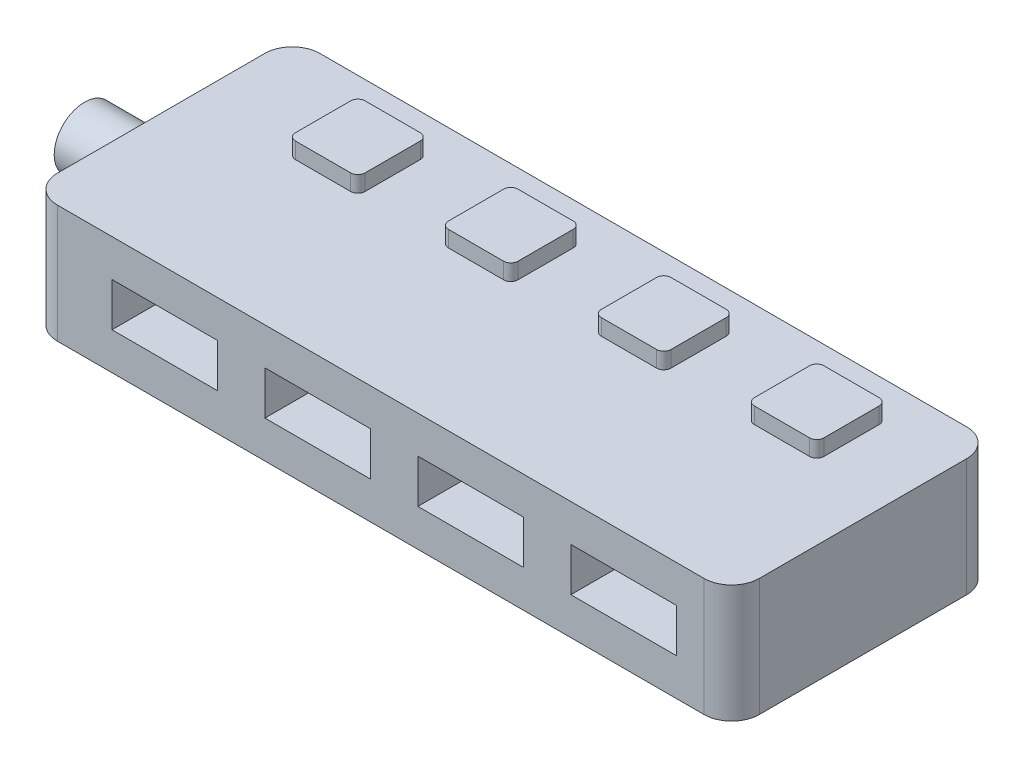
from build123d import *

# Parameters (mm, degrees)
BOSS_EXTRUDE1_DEPTH = 14.097
BOSS_EXTRUDE2_DEPTH = 1.9304
SKETCH4_W           = 12.6111
SKETCH4_H           = 5.207
CUT_EXTRUDE1_DEPTH  = 9.144
SKETCH5_R           = 3.6322
BOSS_EXTRUDE3_DEPTH = 9.144


with BuildPart() as part:
    # Sketch1 → Boss-Extrude1 (new body)
    with BuildSketch(Plane(origin=(0, 0, 0), x_dir=(1, 0, 0), z_dir=(0, 1, 0))):
        with BuildLine():
            Line((0, 0), (0, 24.7904))
            ThreePointArc((0, 24.7904), (0.967133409, 27.125266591), (3.302, 28.0924))
            Line((3.302, 28.0924), (80.6196, 28.0924))
            ThreePointArc((80.6196, 28.0924), (82.954466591, 27.125266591), (83.9216, 24.7904))
            Line((83.9216, 24.7904), (83.9216, 0))
            ThreePointArc((83.9216, 0), (82.954466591, -2.334866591), (80.6196, -3.302))
            Line((80.6196, -3.302), (3.302, -3.302))
            ThreePointArc((3.302, -3.302), (0.967133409, -2.334866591), (0, 0))
        make_face()
    extrude(amount=BOSS_EXTRUDE1_DEPTH)

    # Sketch2 → Boss-Extrude2 (add)
    with BuildSketch(Plane(origin=(0, 14.097, 0), x_dir=(1, 0, 0), z_dir=(0, 1, 0))):
        with BuildLine():
            Line((11.9761, 16.493617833), (11.9761, 23.092282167))
            ThreePointArc((11.9761, 23.092282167), (12.227964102, 23.700335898), (12.836017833, 23.9522))
            Line((12.836017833, 23.9522), (19.434682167, 23.9522))
            ThreePointArc((19.434682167, 23.9522), (20.042735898, 23.700335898), (20.2946, 23.092282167))
            Line((20.2946, 23.092282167), (20.2946, 16.493617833))
            ThreePointArc((20.2946, 16.493617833), (20.042735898, 15.885564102), (19.434682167, 15.6337))
            Line((19.434682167, 15.6337), (12.836017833, 15.6337))
            ThreePointArc((12.836017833, 15.6337), (12.227964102, 15.885564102), (11.9761, 16.493617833))
        make_face()
        with BuildLine():
            Line((30.2641, 16.493617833), (30.2641, 23.092282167))
            ThreePointArc((30.2641, 23.092282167), (30.515964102, 23.700335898), (31.124017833, 23.9522))
            Line((31.124017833, 23.9522), (37.722682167, 23.9522))
            ThreePointArc((37.722682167, 23.9522), (38.330735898, 23.700335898), (38.5826, 23.092282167))
            Line((38.5826, 23.092282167), (38.5826, 16.493617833))
            ThreePointArc((38.5826, 16.493617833), (38.330735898, 15.885564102), (37.722682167, 15.6337))
            Line((37.722682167, 15.6337), (31.124017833, 15.6337))
            ThreePointArc((31.124017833, 15.6337), (30.515964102, 15.885564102), (30.2641, 16.493617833))
        make_face()
        with BuildLine():
            Line((48.5521, 16.493617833), (48.5521, 23.092282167))
            ThreePointArc((48.5521, 23.092282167), (48.803964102, 23.700335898), (49.412017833, 23.9522))
            Line((49.412017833, 23.9522), (56.010682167, 23.9522))
            ThreePointArc((56.010682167, 23.9522), (56.618735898, 23.700335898), (56.8706, 23.092282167))
            Line((56.8706, 23.092282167), (56.8706, 16.493617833))
            ThreePointArc((56.8706, 16.493617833), (56.618735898, 15.885564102), (56.010682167, 15.6337))
            Line((56.010682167, 15.6337), (49.412017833, 15.6337))
            ThreePointArc((49.412017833, 15.6337), (48.803964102, 15.885564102), (48.5521, 16.493617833))
        make_face()
        with BuildLine():
            Line((66.8401, 16.493617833), (66.8401, 23.092282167))
            ThreePointArc((66.8401, 23.092282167), (67.091964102, 23.700335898), (67.700017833, 23.9522))
            Line((67.700017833, 23.9522), (74.298682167, 23.9522))
            ThreePointArc((74.298682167, 23.9522), (74.906735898, 23.700335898), (75.1586, 23.092282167))
            Line((75.1586, 23.092282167), (75.1586, 16.493617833))
            ThreePointArc((75.1586, 16.493617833), (74.906735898, 15.885564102), (74.298682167, 15.6337))
            Line((74.298682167, 15.6337), (67.700017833, 15.6337))
            ThreePointArc((67.700017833, 15.6337), (67.091964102, 15.885564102), (66.8401, 16.493617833))
        make_face()
    extrude(amount=BOSS_EXTRUDE2_DEPTH)

    # Sketch4 → Cut-Extrude1 (cut)
    with BuildSketch(Plane.XY.offset(3.302)):
        with Locations((16.13535, 7.0485)):
            Rectangle(SKETCH4_W, SKETCH4_H)
        with Locations((34.42335, 7.0485)):
            Rectangle(SKETCH4_W, SKETCH4_H)
        with Locations((52.71135, 7.0485)):
            Rectangle(SKETCH4_W, SKETCH4_H)
        with Locations((70.99935, 7.0485)):
            Rectangle(SKETCH4_W, SKETCH4_H)
    extrude(amount=-CUT_EXTRUDE1_DEPTH, mode=Mode.SUBTRACT)

    # Sketch5 → Boss-Extrude3 (add)
    with BuildSketch(Plane.ZY):
        with Locations(Location((-12.3952, 7.0485, 0), (0, 0, 180))):
            Circle(SKETCH5_R)
    extrude(amount=BOSS_EXTRUDE3_DEPTH)


solid = part.part
